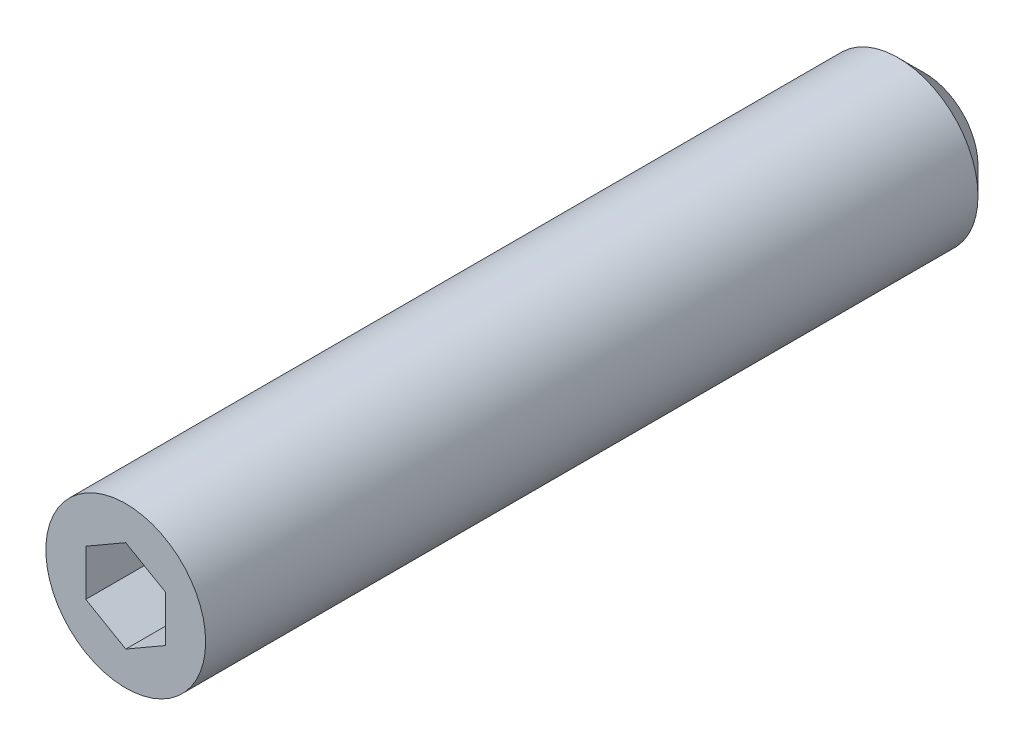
ISO-10303-21;
HEADER;
FILE_DESCRIPTION(('STEP AP214'),'2;1');
FILE_NAME('part.step','',(''),(''),'','','');
FILE_SCHEMA(('AUTOMOTIVE_DESIGN { 1 0 10303 214 1 1 1 1 }'));
ENDSEC;
DATA;
#1=APPLICATION_CONTEXT('core data for automotive mechanical design processes');
#2=APPLICATION_PROTOCOL_DEFINITION('international standard','automotive_design',2000,#1);
#3=PRODUCT_CONTEXT('',#1,'mechanical');
#4=PRODUCT('Part','Part','',(#3));
#5=PRODUCT_RELATED_PRODUCT_CATEGORY('part','',(#4));
#6=PRODUCT_DEFINITION_FORMATION('','',#4);
#7=PRODUCT_DEFINITION_CONTEXT('part definition',#1,'design');
#8=PRODUCT_DEFINITION('design','',#6,#7);
#9=PRODUCT_DEFINITION_SHAPE('','',#8);
#10=(LENGTH_UNIT() NAMED_UNIT(*) SI_UNIT(.MILLI.,.METRE.));
#11=(NAMED_UNIT(*) PLANE_ANGLE_UNIT() SI_UNIT($,.RADIAN.));
#12=(NAMED_UNIT(*) SI_UNIT($,.STERADIAN.) SOLID_ANGLE_UNIT());
#13=UNCERTAINTY_MEASURE_WITH_UNIT(LENGTH_MEASURE(1.E-05),#10,'distance_accuracy_value','');
#14=(GEOMETRIC_REPRESENTATION_CONTEXT(3) GLOBAL_UNCERTAINTY_ASSIGNED_CONTEXT((#13)) GLOBAL_UNIT_ASSIGNED_CONTEXT((#10,
#11,#12)) REPRESENTATION_CONTEXT('',''));
#15=CARTESIAN_POINT('',(0.,0.,0.));
#16=DIRECTION('',(0.,0.,1.));
#17=DIRECTION('',(1.,0.,0.));
#18=AXIS2_PLACEMENT_3D('',#15,#16,#17);
#19=CARTESIAN_POINT('',(0.,3.46,54.));
#20=DIRECTION('',(-0.5,-0.866025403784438,0.));
#21=DIRECTION('',(0.866025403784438,-0.5,0.));
#22=AXIS2_PLACEMENT_3D('',#19,#20,#21);
#23=PLANE('',#22);
#24=DIRECTION('',(0.,0.,1.));
#25=VECTOR('',#24,1.);
#26=CARTESIAN_POINT('',(3.,1.72794919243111,54.));
#27=LINE('',#26,#25);
#28=CARTESIAN_POINT('',(3.,1.72794919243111,54.));
#29=VERTEX_POINT('',#28);
#30=CARTESIAN_POINT('',(3.,1.72794919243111,60.));
#31=VERTEX_POINT('',#30);
#32=EDGE_CURVE('E37',#29,#31,#27,.T.);
#33=ORIENTED_EDGE('',*,*,#32,.T.);
#34=DIRECTION('',(0.866025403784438,-0.5,0.));
#35=VECTOR('',#34,1.);
#36=CARTESIAN_POINT('',(0.,3.46,60.));
#37=LINE('',#36,#35);
#38=CARTESIAN_POINT('',(0.,3.46,60.));
#39=VERTEX_POINT('',#38);
#40=EDGE_CURVE('E29',#39,#31,#37,.T.);
#41=ORIENTED_EDGE('',*,*,#40,.F.);
#42=DIRECTION('',(0.,0.,1.));
#43=VECTOR('',#42,1.);
#44=CARTESIAN_POINT('',(0.,3.46,54.));
#45=LINE('',#44,#43);
#46=CARTESIAN_POINT('',(0.,3.46,54.));
#47=VERTEX_POINT('',#46);
#48=EDGE_CURVE('E93',#47,#39,#45,.T.);
#49=ORIENTED_EDGE('',*,*,#48,.F.);
#50=DIRECTION('',(0.866025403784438,-0.5,0.));
#51=VECTOR('',#50,1.);
#52=CARTESIAN_POINT('',(0.,3.46,54.));
#53=LINE('',#52,#51);
#54=EDGE_CURVE('E96',#47,#29,#53,.T.);
#55=ORIENTED_EDGE('',*,*,#54,.T.);
#56=EDGE_LOOP('',(#33,#41,#49,#55));
#57=FACE_BOUND('',#56,.T.);
#58=ADVANCED_FACE('F14',(#57),#23,.T.);
#59=CARTESIAN_POINT('',(3.,1.72794919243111,54.));
#60=DIRECTION('',(-1.,0.,0.));
#61=DIRECTION('',(0.,-1.,0.));
#62=AXIS2_PLACEMENT_3D('',#59,#60,#61);
#63=PLANE('',#62);
#64=DIRECTION('',(0.,0.,1.));
#65=VECTOR('',#64,1.);
#66=CARTESIAN_POINT('',(3.,-1.72794919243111,54.));
#67=LINE('',#66,#65);
#68=CARTESIAN_POINT('',(3.,-1.72794919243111,54.));
#69=VERTEX_POINT('',#68);
#70=CARTESIAN_POINT('',(3.,-1.72794919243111,60.));
#71=VERTEX_POINT('',#70);
#72=EDGE_CURVE('E72',#69,#71,#67,.T.);
#73=ORIENTED_EDGE('',*,*,#72,.T.);
#74=DIRECTION('',(0.,-1.,0.));
#75=VECTOR('',#74,1.);
#76=CARTESIAN_POINT('',(3.,1.72794919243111,60.));
#77=LINE('',#76,#75);
#78=EDGE_CURVE('E151',#31,#71,#77,.T.);
#79=ORIENTED_EDGE('',*,*,#78,.F.);
#80=ORIENTED_EDGE('',*,*,#32,.F.);
#81=DIRECTION('',(0.,-1.,0.));
#82=VECTOR('',#81,1.);
#83=CARTESIAN_POINT('',(3.,1.72794919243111,54.));
#84=LINE('',#83,#82);
#85=EDGE_CURVE('E81',#29,#69,#84,.T.);
#86=ORIENTED_EDGE('',*,*,#85,.T.);
#87=EDGE_LOOP('',(#73,#79,#80,#86));
#88=FACE_BOUND('',#87,.T.);
#89=ADVANCED_FACE('F122',(#88),#63,.T.);
#90=CARTESIAN_POINT('',(0.,-3.46,54.));
#91=DIRECTION('',(0.5,-0.866025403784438,0.));
#92=DIRECTION('',(0.866025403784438,0.5,0.));
#93=AXIS2_PLACEMENT_3D('',#90,#91,#92);
#94=PLANE('',#93);
#95=DIRECTION('',(0.,0.,1.));
#96=VECTOR('',#95,1.);
#97=CARTESIAN_POINT('',(0.,-3.46,54.));
#98=LINE('',#97,#96);
#99=CARTESIAN_POINT('',(0.,-3.46,54.));
#100=VERTEX_POINT('',#99);
#101=CARTESIAN_POINT('',(0.,-3.46,60.));
#102=VERTEX_POINT('',#101);
#103=EDGE_CURVE('E59',#100,#102,#98,.T.);
#104=ORIENTED_EDGE('',*,*,#103,.T.);
#105=DIRECTION('',(0.866025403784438,0.5,0.));
#106=VECTOR('',#105,1.);
#107=CARTESIAN_POINT('',(0.,-3.46,60.));
#108=LINE('',#107,#106);
#109=EDGE_CURVE('E157',#102,#71,#108,.T.);
#110=ORIENTED_EDGE('',*,*,#109,.T.);
#111=ORIENTED_EDGE('',*,*,#72,.F.);
#112=DIRECTION('',(0.866025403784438,0.5,0.));
#113=VECTOR('',#112,1.);
#114=CARTESIAN_POINT('',(0.,-3.46,54.));
#115=LINE('',#114,#113);
#116=EDGE_CURVE('E76',#100,#69,#115,.T.);
#117=ORIENTED_EDGE('',*,*,#116,.F.);
#118=EDGE_LOOP('',(#104,#110,#111,#117));
#119=FACE_BOUND('',#118,.T.);
#120=ADVANCED_FACE('F77',(#119),#94,.F.);
#121=CARTESIAN_POINT('',(0.,-3.46,54.));
#122=DIRECTION('',(0.5,0.866025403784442,0.));
#123=DIRECTION('',(-0.866025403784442,0.5,0.));
#124=AXIS2_PLACEMENT_3D('',#121,#122,#123);
#125=PLANE('',#124);
#126=DIRECTION('',(0.,0.,1.));
#127=VECTOR('',#126,1.);
#128=CARTESIAN_POINT('',(-3.,-1.72794919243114,54.));
#129=LINE('',#128,#127);
#130=CARTESIAN_POINT('',(-3.,-1.72794919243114,54.));
#131=VERTEX_POINT('',#130);
#132=CARTESIAN_POINT('',(-3.,-1.72794919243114,60.));
#133=VERTEX_POINT('',#132);
#134=EDGE_CURVE('E73',#131,#133,#129,.T.);
#135=ORIENTED_EDGE('',*,*,#134,.T.);
#136=DIRECTION('',(-0.866025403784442,0.5,0.));
#137=VECTOR('',#136,1.);
#138=CARTESIAN_POINT('',(0.,-3.46,60.));
#139=LINE('',#138,#137);
#140=EDGE_CURVE('E68',#102,#133,#139,.T.);
#141=ORIENTED_EDGE('',*,*,#140,.F.);
#142=ORIENTED_EDGE('',*,*,#103,.F.);
#143=DIRECTION('',(-0.866025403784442,0.5,0.));
#144=VECTOR('',#143,1.);
#145=CARTESIAN_POINT('',(0.,-3.46,54.));
#146=LINE('',#145,#144);
#147=EDGE_CURVE('E64',#100,#131,#146,.T.);
#148=ORIENTED_EDGE('',*,*,#147,.T.);
#149=EDGE_LOOP('',(#135,#141,#142,#148));
#150=FACE_BOUND('',#149,.T.);
#151=ADVANCED_FACE('F62',(#150),#125,.T.);
#152=CARTESIAN_POINT('',(-3.,1.72794919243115,54.));
#153=DIRECTION('',(-1.,0.,0.));
#154=DIRECTION('',(0.,0.,1.));
#155=AXIS2_PLACEMENT_3D('',#152,#153,#154);
#156=PLANE('',#155);
#157=DIRECTION('',(0.,0.,1.));
#158=VECTOR('',#157,1.);
#159=CARTESIAN_POINT('',(-3.,1.72794919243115,54.));
#160=LINE('',#159,#158);
#161=CARTESIAN_POINT('',(-3.,1.72794919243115,54.));
#162=VERTEX_POINT('',#161);
#163=CARTESIAN_POINT('',(-3.,1.72794919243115,60.));
#164=VERTEX_POINT('',#163);
#165=EDGE_CURVE('E95',#162,#164,#160,.T.);
#166=ORIENTED_EDGE('',*,*,#165,.T.);
#167=DIRECTION('',(0.,-1.,0.));
#168=VECTOR('',#167,1.);
#169=CARTESIAN_POINT('',(-3.,1.72794919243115,60.));
#170=LINE('',#169,#168);
#171=EDGE_CURVE('E162',#164,#133,#170,.T.);
#172=ORIENTED_EDGE('',*,*,#171,.T.);
#173=ORIENTED_EDGE('',*,*,#134,.F.);
#174=DIRECTION('',(0.,-1.,0.));
#175=VECTOR('',#174,1.);
#176=CARTESIAN_POINT('',(-3.,1.72794919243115,54.));
#177=LINE('',#176,#175);
#178=EDGE_CURVE('E87',#162,#131,#177,.T.);
#179=ORIENTED_EDGE('',*,*,#178,.F.);
#180=EDGE_LOOP('',(#166,#172,#173,#179));
#181=FACE_BOUND('',#180,.T.);
#182=ADVANCED_FACE('F133',(#181),#156,.F.);
#183=CARTESIAN_POINT('',(0.,3.46,54.));
#184=DIRECTION('',(-0.499999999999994,0.866025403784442,0.));
#185=DIRECTION('',(-0.866025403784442,-0.499999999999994,0.));
#186=AXIS2_PLACEMENT_3D('',#183,#184,#185);
#187=PLANE('',#186);
#188=DIRECTION('',(-0.866025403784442,-0.499999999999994,0.));
#189=VECTOR('',#188,1.);
#190=CARTESIAN_POINT('',(0.,3.46,54.));
#191=LINE('',#190,#189);
#192=EDGE_CURVE('E89',#47,#162,#191,.T.);
#193=ORIENTED_EDGE('',*,*,#192,.F.);
#194=ORIENTED_EDGE('',*,*,#48,.T.);
#195=DIRECTION('',(-0.866025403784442,-0.499999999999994,0.));
#196=VECTOR('',#195,1.);
#197=CARTESIAN_POINT('',(0.,3.46,60.));
#198=LINE('',#197,#196);
#199=EDGE_CURVE('E154',#39,#164,#198,.T.);
#200=ORIENTED_EDGE('',*,*,#199,.T.);
#201=ORIENTED_EDGE('',*,*,#165,.F.);
#202=EDGE_LOOP('',(#193,#194,#200,#201));
#203=FACE_BOUND('',#202,.T.);
#204=ADVANCED_FACE('F130',(#203),#187,.F.);
#205=CARTESIAN_POINT('',(5.9928957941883,0.,54.));
#206=DIRECTION('',(0.,0.,1.));
#207=DIRECTION('',(1.,0.,0.));
#208=AXIS2_PLACEMENT_3D('',#205,#206,#207);
#209=PLANE('',#208);
#210=ORIENTED_EDGE('',*,*,#54,.F.);
#211=ORIENTED_EDGE('',*,*,#192,.T.);
#212=ORIENTED_EDGE('',*,*,#178,.T.);
#213=ORIENTED_EDGE('',*,*,#147,.F.);
#214=ORIENTED_EDGE('',*,*,#116,.T.);
#215=ORIENTED_EDGE('',*,*,#85,.F.);
#216=EDGE_LOOP('',(#210,#211,#212,#213,#214,#215));
#217=FACE_BOUND('',#216,.T.);
#218=ADVANCED_FACE('F84',(#217),#209,.T.);
#219=CARTESIAN_POINT('',(6.,0.,60.));
#220=DIRECTION('',(0.,0.,-1.));
#221=DIRECTION('',(-1.,0.,0.));
#222=AXIS2_PLACEMENT_3D('',#219,#220,#221);
#223=PLANE('',#222);
#224=CARTESIAN_POINT('',(0.,0.,60.));
#225=DIRECTION('',(0.,0.,1.));
#226=DIRECTION('',(1.,0.,0.));
#227=AXIS2_PLACEMENT_3D('',#224,#225,#226);
#228=CIRCLE('',#227,6.);
#229=CARTESIAN_POINT('',(6.,0.,60.));
#230=VERTEX_POINT('',#229);
#231=EDGE_CURVE('E102',#230,#230,#228,.T.);
#232=ORIENTED_EDGE('',*,*,#231,.T.);
#233=EDGE_LOOP('',(#232));
#234=FACE_BOUND('',#233,.T.);
#235=ORIENTED_EDGE('',*,*,#40,.T.);
#236=ORIENTED_EDGE('',*,*,#78,.T.);
#237=ORIENTED_EDGE('',*,*,#109,.F.);
#238=ORIENTED_EDGE('',*,*,#140,.T.);
#239=ORIENTED_EDGE('',*,*,#171,.F.);
#240=ORIENTED_EDGE('',*,*,#199,.F.);
#241=EDGE_LOOP('',(#235,#236,#237,#238,#239,#240));
#242=FACE_BOUND('',#241,.T.);
#243=ADVANCED_FACE('F119',(#234,#242),#223,.F.);
#244=CARTESIAN_POINT('',(0.,0.,0.));
#245=DIRECTION('',(0.,0.,1.));
#246=DIRECTION('',(1.,0.,0.));
#247=AXIS2_PLACEMENT_3D('',#244,#245,#246);
#248=PLANE('',#247);
#249=CARTESIAN_POINT('',(0.,0.,0.));
#250=DIRECTION('',(0.,0.,1.));
#251=DIRECTION('',(1.,0.,0.));
#252=AXIS2_PLACEMENT_3D('',#249,#250,#251);
#253=CIRCLE('',#252,4.);
#254=CARTESIAN_POINT('',(4.,0.,0.));
#255=VERTEX_POINT('',#254);
#256=EDGE_CURVE('E9',#255,#255,#253,.T.);
#257=ORIENTED_EDGE('',*,*,#256,.F.);
#258=EDGE_LOOP('',(#257));
#259=FACE_BOUND('',#258,.T.);
#260=ADVANCED_FACE('F16',(#259),#248,.F.);
#261=CARTESIAN_POINT('',(0.,0.,2.));
#262=DIRECTION('',(0.,0.,1.));
#263=DIRECTION('',(1.,0.,0.));
#264=AXIS2_PLACEMENT_3D('',#261,#262,#263);
#265=CONICAL_SURFACE('',#264,6.,0.785398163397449);
#266=ORIENTED_EDGE('',*,*,#256,.T.);
#267=EDGE_LOOP('',(#266));
#268=FACE_BOUND('',#267,.T.);
#269=CARTESIAN_POINT('',(0.,0.,2.));
#270=DIRECTION('',(0.,0.,1.));
#271=DIRECTION('',(1.,0.,0.));
#272=AXIS2_PLACEMENT_3D('',#269,#270,#271);
#273=CIRCLE('',#272,6.);
#274=CARTESIAN_POINT('',(6.,0.,2.));
#275=VERTEX_POINT('',#274);
#276=EDGE_CURVE('E22',#275,#275,#273,.T.);
#277=ORIENTED_EDGE('',*,*,#276,.F.);
#278=EDGE_LOOP('',(#277));
#279=FACE_BOUND('',#278,.T.);
#280=ADVANCED_FACE('F109',(#268,#279),#265,.T.);
#281=CARTESIAN_POINT('',(0.,0.,110.));
#282=DIRECTION('',(0.,0.,1.));
#283=DIRECTION('',(1.,0.,0.));
#284=AXIS2_PLACEMENT_3D('',#281,#282,#283);
#285=CYLINDRICAL_SURFACE('',#284,6.);
#286=ORIENTED_EDGE('',*,*,#231,.F.);
#287=EDGE_LOOP('',(#286));
#288=FACE_BOUND('',#287,.T.);
#289=ORIENTED_EDGE('',*,*,#276,.T.);
#290=EDGE_LOOP('',(#289));
#291=FACE_BOUND('',#290,.T.);
#292=ADVANCED_FACE('F107',(#288,#291),#285,.T.);
#293=CLOSED_SHELL('',(#58,#89,#120,#151,#182,#204,#218,#243,#260,#280,#292));
#294=MANIFOLD_SOLID_BREP('B1',#293);
#295=ADVANCED_BREP_SHAPE_REPRESENTATION('',(#18,#294),#14);
#296=SHAPE_DEFINITION_REPRESENTATION(#9,#295);
ENDSEC;
END-ISO-10303-21;
